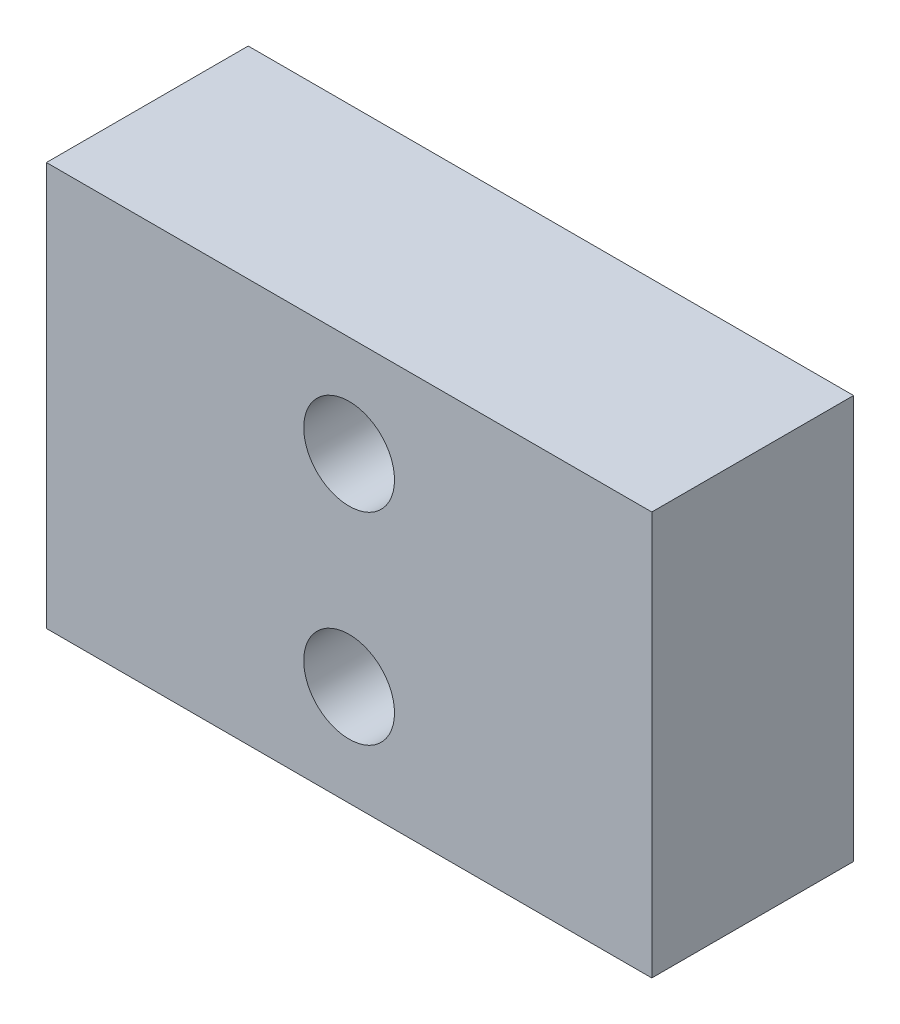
from build123d import *

# Parameters (mm, degrees)
SKETCH_1_W        = 30
SKETCH_1_H        = 20
EXTRUDE_1_DEPTH   = 10
HOLE_WIZARD_M41_D = 4.5


with BuildPart() as part:
    # Sketch 1 → Extrude 1 (new body)
    with BuildSketch(Plane.XY):
        Rectangle(SKETCH_1_W, SKETCH_1_H)
    extrude(amount=EXTRUDE_1_DEPTH)

    # Hole Wizard M41 (through all)
    with Locations(Plane.XY.offset(10)):
        with Locations((0, -5), (0, 5)):
            Hole(HOLE_WIZARD_M41_D / 2)


solid = part.part
